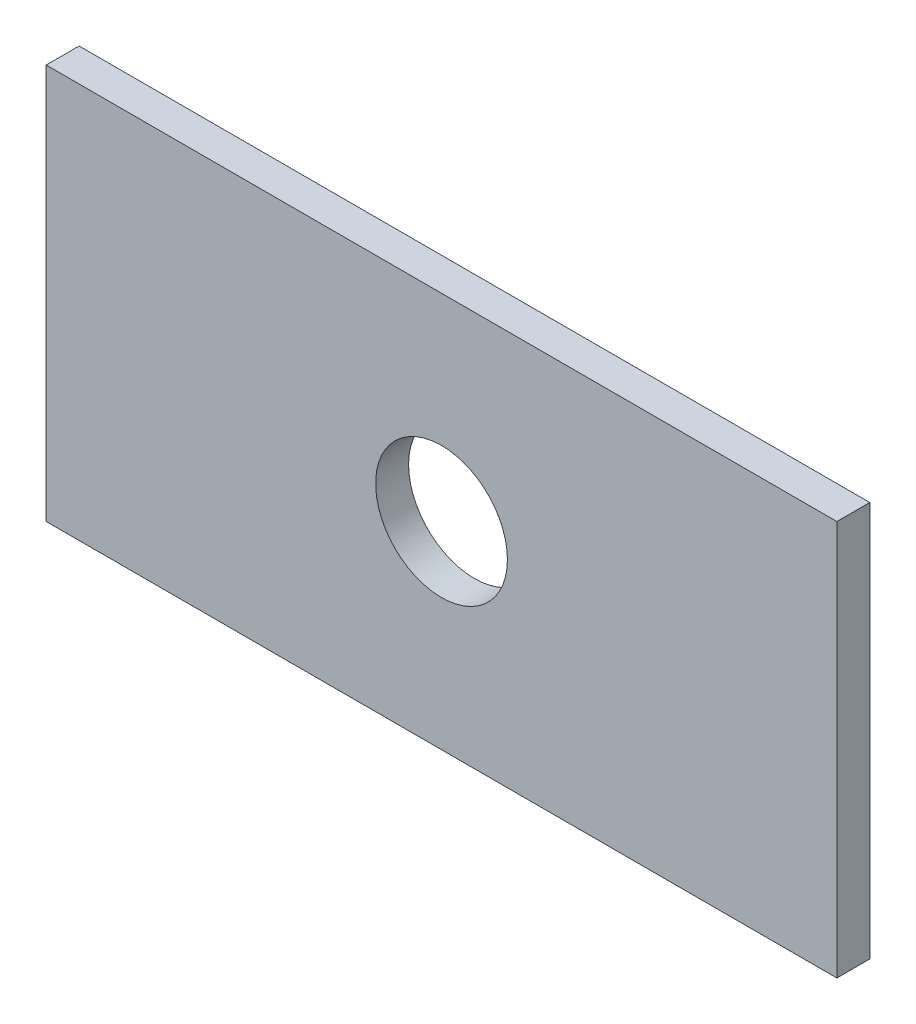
from build123d import *

# Parameters (mm, degrees)
SKIZZE1_W                    = 120
SKIZZE1_H                    = 60
LINEAR_AUSTRAGEN1_DEPTH      = 5
DURCHGANGSLOCH_F_R_M61_D     = 20
DURCHGANGSLOCH_F_R_M61_DEPTH = 100


with BuildPart() as part:
    # Skizze1 → Linear austragen1 (new body)
    with BuildSketch(Plane.XY):
        with Locations((60, 30)):
            Rectangle(SKIZZE1_W, SKIZZE1_H)
    extrude(amount=LINEAR_AUSTRAGEN1_DEPTH)

    # Durchgangsloch f_r M61
    with Locations(Plane.XY.offset(5)):
        with Locations((60, 30)):
            Hole(DURCHGANGSLOCH_F_R_M61_D / 2, depth=DURCHGANGSLOCH_F_R_M61_DEPTH)


solid = part.part
